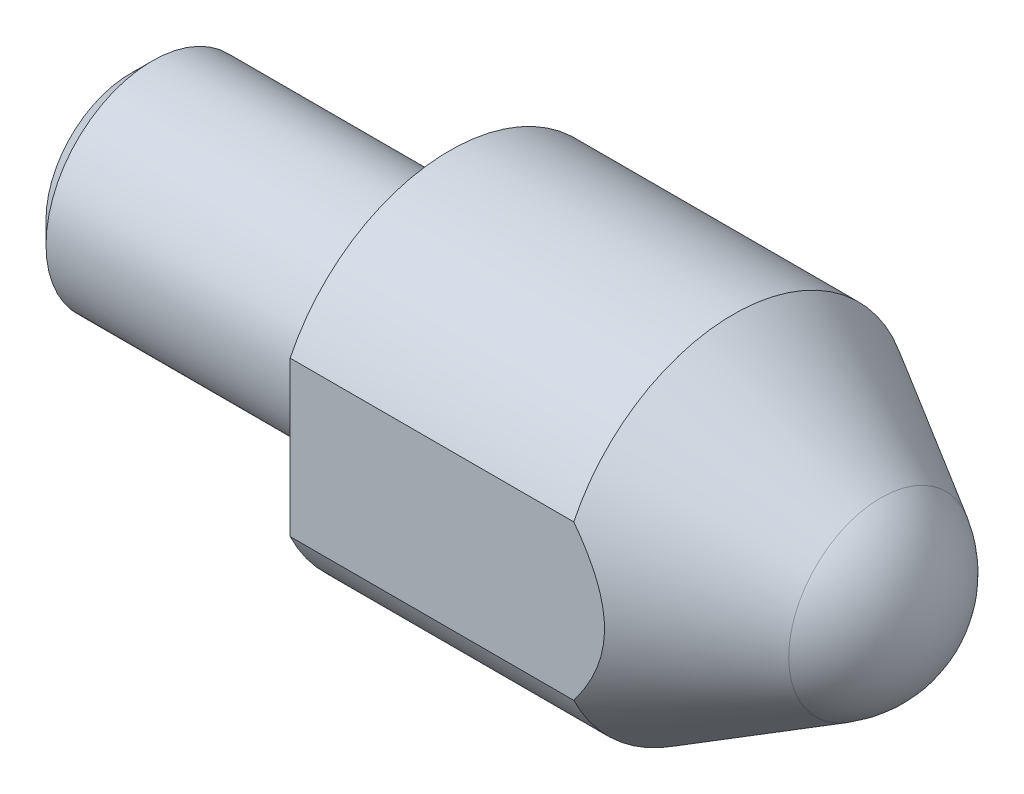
from build123d import *

# Parameters (mm, degrees)
SKETCH3_W          = 36
SKETCH3_H          = 40
SKETCH3_W_2        = 9
SKETCH3_H_2        = 20
CUT_EXTRUDE1_DEPTH = 13


with BuildPart() as part:
    # Sketch1 → Revolve1 (revolve)
    with BuildSketch(Plane.XY, mode=Mode.PRIVATE) as revolve1_sk:
        Polygon((-9, 0), (-9, 2.3865), (-8.3865, 3), (0, 3), (0, 0), align=None)
    revolve(revolve1_sk.sketch.rotate(Axis((0, 0, 0), (-1, 0, 0)), 270), axis=Axis((0, 0, 0), (-1, 0, 0)))

    # Sketch2 → Revolve2 (revolve)
    with BuildSketch(Plane.XY, mode=Mode.PRIVATE) as revolve2_sk:
        with BuildLine():
            Line((0, 0), (0, 5))
            Line((0, 5), (8, 5))
            Line((8, 5), (12.160254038, 2.598076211))
            ThreePointArc((12.160254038, 2.598076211), (13.258330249, 1.5), (13.660254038, 0))
            Line((13.660254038, 0), (0, 0))
        make_face()
    revolve(revolve2_sk.sketch.rotate(Axis((13.660254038, 0, 0), (-1, 0, 0)), 180), axis=Axis((13.660254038, 0, 0), (-1, 0, 0)))

    # Sketch3 → Cut-Extrude1 (cut)
    with BuildSketch(Plane(origin=(-1, 0, 0), x_dir=(0, 0, -1), z_dir=(1, 0, 0))):
        Rectangle(SKETCH3_W, SKETCH3_H)
        Rectangle(SKETCH3_W_2, SKETCH3_H_2, mode=Mode.SUBTRACT)
    extrude(amount=CUT_EXTRUDE1_DEPTH, mode=Mode.SUBTRACT)


solid = part.part
